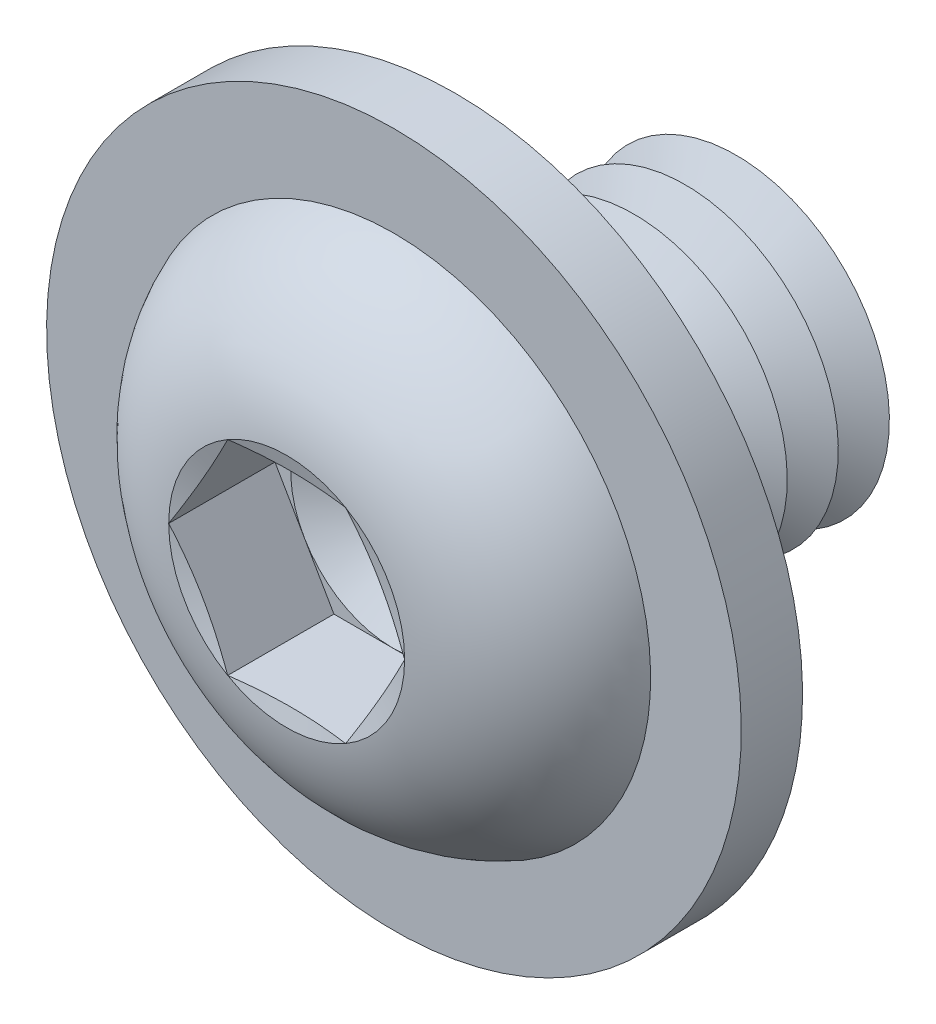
ISO-10303-21;
HEADER;
FILE_DESCRIPTION(('STEP AP214'),'2;1');
FILE_NAME('part.step','',(''),(''),'','','');
FILE_SCHEMA(('AUTOMOTIVE_DESIGN { 1 0 10303 214 1 1 1 1 }'));
ENDSEC;
DATA;
#1=APPLICATION_CONTEXT('core data for automotive mechanical design processes');
#2=APPLICATION_PROTOCOL_DEFINITION('international standard','automotive_design',2000,#1);
#3=PRODUCT_CONTEXT('',#1,'mechanical');
#4=PRODUCT('Part','Part','',(#3));
#5=PRODUCT_RELATED_PRODUCT_CATEGORY('part','',(#4));
#6=PRODUCT_DEFINITION_FORMATION('','',#4);
#7=PRODUCT_DEFINITION_CONTEXT('part definition',#1,'design');
#8=PRODUCT_DEFINITION('design','',#6,#7);
#9=PRODUCT_DEFINITION_SHAPE('','',#8);
#10=(LENGTH_UNIT() NAMED_UNIT(*) SI_UNIT(.MILLI.,.METRE.));
#11=(NAMED_UNIT(*) PLANE_ANGLE_UNIT() SI_UNIT($,.RADIAN.));
#12=(NAMED_UNIT(*) SI_UNIT($,.STERADIAN.) SOLID_ANGLE_UNIT());
#13=UNCERTAINTY_MEASURE_WITH_UNIT(LENGTH_MEASURE(1.E-05),#10,'distance_accuracy_value','');
#14=(GEOMETRIC_REPRESENTATION_CONTEXT(3) GLOBAL_UNCERTAINTY_ASSIGNED_CONTEXT((#13)) GLOBAL_UNIT_ASSIGNED_CONTEXT((#10,
#11,#12)) REPRESENTATION_CONTEXT('',''));
#15=CARTESIAN_POINT('',(0.,0.,0.));
#16=DIRECTION('',(0.,0.,1.));
#17=DIRECTION('',(1.,0.,0.));
#18=AXIS2_PLACEMENT_3D('',#15,#16,#17);
#19=CARTESIAN_POINT('',(0.,0.,-2.50000000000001));
#20=DIRECTION('',(0.,0.,1.));
#21=DIRECTION('',(0.,-1.,0.));
#22=AXIS2_PLACEMENT_3D('',#19,#20,#21);
#23=CONICAL_SURFACE('',#22,2.99999999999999,1.0471975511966);
#24=CARTESIAN_POINT('',(0.,0.,-3.00000000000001));
#25=DIRECTION('',(0.,0.,1.));
#26=DIRECTION('',(0.,-1.,0.));
#27=AXIS2_PLACEMENT_3D('',#24,#25,#26);
#28=CIRCLE('',#27,2.13397459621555);
#29=CARTESIAN_POINT('',(0.,-2.13397459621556,-3.00000000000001));
#30=VERTEX_POINT('',#29);
#31=EDGE_CURVE('E256',#30,#30,#28,.T.);
#32=ORIENTED_EDGE('',*,*,#31,.T.);
#33=EDGE_LOOP('',(#32));
#34=FACE_BOUND('',#33,.T.);
#35=CARTESIAN_POINT('',(0.,0.,-2.50000000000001));
#36=DIRECTION('',(0.,0.,1.));
#37=DIRECTION('',(0.,-1.,0.));
#38=AXIS2_PLACEMENT_3D('',#35,#36,#37);
#39=CIRCLE('',#38,2.99999999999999);
#40=CARTESIAN_POINT('',(0.,-3.,-2.50000000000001));
#41=VERTEX_POINT('',#40);
#42=EDGE_CURVE('E252',#41,#41,#39,.T.);
#43=ORIENTED_EDGE('',*,*,#42,.F.);
#44=EDGE_LOOP('',(#43));
#45=FACE_BOUND('',#44,.T.);
#46=ADVANCED_FACE('F39',(#34,#45),#23,.T.);
#47=CARTESIAN_POINT('',(0.,0.,-3.00000000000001));
#48=DIRECTION('',(0.,0.,-1.));
#49=DIRECTION('',(0.,1.,0.));
#50=AXIS2_PLACEMENT_3D('',#47,#48,#49);
#51=CONICAL_SURFACE('',#50,2.13397459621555,1.0471975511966);
#52=CARTESIAN_POINT('',(0.,0.,-3.50000000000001));
#53=DIRECTION('',(0.,0.,1.));
#54=DIRECTION('',(0.,-1.,0.));
#55=AXIS2_PLACEMENT_3D('',#52,#53,#54);
#56=CIRCLE('',#55,2.99999999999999);
#57=CARTESIAN_POINT('',(0.,-3.,-3.50000000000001));
#58=VERTEX_POINT('',#57);
#59=EDGE_CURVE('E260',#58,#58,#56,.T.);
#60=ORIENTED_EDGE('',*,*,#59,.T.);
#61=EDGE_LOOP('',(#60));
#62=FACE_BOUND('',#61,.T.);
#63=ORIENTED_EDGE('',*,*,#31,.F.);
#64=EDGE_LOOP('',(#63));
#65=FACE_BOUND('',#64,.T.);
#66=ADVANCED_FACE('F377',(#62,#65),#51,.T.);
#67=CARTESIAN_POINT('',(0.,2.99999999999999,-6.));
#68=DIRECTION('',(0.,0.,-1.));
#69=DIRECTION('',(0.,1.,0.));
#70=AXIS2_PLACEMENT_3D('',#67,#68,#69);
#71=PLANE('',#70);
#72=CARTESIAN_POINT('',(0.,0.,-6.00000000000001));
#73=DIRECTION('',(0.,0.,1.));
#74=DIRECTION('',(0.,-1.,0.));
#75=AXIS2_PLACEMENT_3D('',#72,#73,#74);
#76=CIRCLE('',#75,2.13397459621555);
#77=CARTESIAN_POINT('',(0.,-2.13397459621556,-6.00000000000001));
#78=VERTEX_POINT('',#77);
#79=EDGE_CURVE('E280',#78,#78,#76,.T.);
#80=ORIENTED_EDGE('',*,*,#79,.F.);
#81=EDGE_LOOP('',(#80));
#82=FACE_BOUND('',#81,.T.);
#83=ADVANCED_FACE('F383',(#82),#71,.T.);
#84=CARTESIAN_POINT('',(0.,0.,-5.50000000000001));
#85=DIRECTION('',(0.,0.,1.));
#86=DIRECTION('',(0.,-1.,0.));
#87=AXIS2_PLACEMENT_3D('',#84,#85,#86);
#88=CONICAL_SURFACE('',#87,2.99999999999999,1.0471975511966);
#89=ORIENTED_EDGE('',*,*,#79,.T.);
#90=EDGE_LOOP('',(#89));
#91=FACE_BOUND('',#90,.T.);
#92=CARTESIAN_POINT('',(0.,0.,-5.50000000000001));
#93=DIRECTION('',(0.,0.,1.));
#94=DIRECTION('',(0.,-1.,0.));
#95=AXIS2_PLACEMENT_3D('',#92,#93,#94);
#96=CIRCLE('',#95,2.99999999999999);
#97=CARTESIAN_POINT('',(0.,-3.,-5.50000000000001));
#98=VERTEX_POINT('',#97);
#99=EDGE_CURVE('E276',#98,#98,#96,.T.);
#100=ORIENTED_EDGE('',*,*,#99,.F.);
#101=EDGE_LOOP('',(#100));
#102=FACE_BOUND('',#101,.T.);
#103=ADVANCED_FACE('F402',(#91,#102),#88,.T.);
#104=CARTESIAN_POINT('',(0.,0.,-5.00000000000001));
#105=DIRECTION('',(0.,0.,-1.));
#106=DIRECTION('',(0.,1.,0.));
#107=AXIS2_PLACEMENT_3D('',#104,#105,#106);
#108=CONICAL_SURFACE('',#107,2.13397459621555,1.0471975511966);
#109=ORIENTED_EDGE('',*,*,#99,.T.);
#110=EDGE_LOOP('',(#109));
#111=FACE_BOUND('',#110,.T.);
#112=CARTESIAN_POINT('',(0.,0.,-5.00000000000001));
#113=DIRECTION('',(0.,0.,1.));
#114=DIRECTION('',(0.,-1.,0.));
#115=AXIS2_PLACEMENT_3D('',#112,#113,#114);
#116=CIRCLE('',#115,2.13397459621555);
#117=CARTESIAN_POINT('',(0.,-2.13397459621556,-5.00000000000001));
#118=VERTEX_POINT('',#117);
#119=EDGE_CURVE('E272',#118,#118,#116,.T.);
#120=ORIENTED_EDGE('',*,*,#119,.F.);
#121=EDGE_LOOP('',(#120));
#122=FACE_BOUND('',#121,.T.);
#123=ADVANCED_FACE('F399',(#111,#122),#108,.T.);
#124=CARTESIAN_POINT('',(0.,0.,-4.50000000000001));
#125=DIRECTION('',(0.,0.,1.));
#126=DIRECTION('',(0.,-1.,0.));
#127=AXIS2_PLACEMENT_3D('',#124,#125,#126);
#128=CONICAL_SURFACE('',#127,2.99999999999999,1.0471975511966);
#129=ORIENTED_EDGE('',*,*,#119,.T.);
#130=EDGE_LOOP('',(#129));
#131=FACE_BOUND('',#130,.T.);
#132=CARTESIAN_POINT('',(0.,0.,-4.50000000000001));
#133=DIRECTION('',(0.,0.,1.));
#134=DIRECTION('',(0.,-1.,0.));
#135=AXIS2_PLACEMENT_3D('',#132,#133,#134);
#136=CIRCLE('',#135,2.99999999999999);
#137=CARTESIAN_POINT('',(0.,-3.,-4.50000000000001));
#138=VERTEX_POINT('',#137);
#139=EDGE_CURVE('E268',#138,#138,#136,.T.);
#140=ORIENTED_EDGE('',*,*,#139,.F.);
#141=EDGE_LOOP('',(#140));
#142=FACE_BOUND('',#141,.T.);
#143=ADVANCED_FACE('F393',(#131,#142),#128,.T.);
#144=CARTESIAN_POINT('',(0.,0.,-4.00000000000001));
#145=DIRECTION('',(0.,0.,-1.));
#146=DIRECTION('',(0.,1.,0.));
#147=AXIS2_PLACEMENT_3D('',#144,#145,#146);
#148=CONICAL_SURFACE('',#147,2.13397459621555,1.0471975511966);
#149=ORIENTED_EDGE('',*,*,#139,.T.);
#150=EDGE_LOOP('',(#149));
#151=FACE_BOUND('',#150,.T.);
#152=CARTESIAN_POINT('',(0.,0.,-4.00000000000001));
#153=DIRECTION('',(0.,0.,1.));
#154=DIRECTION('',(0.,-1.,0.));
#155=AXIS2_PLACEMENT_3D('',#152,#153,#154);
#156=CIRCLE('',#155,2.13397459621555);
#157=CARTESIAN_POINT('',(0.,-2.13397459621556,-4.00000000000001));
#158=VERTEX_POINT('',#157);
#159=EDGE_CURVE('E264',#158,#158,#156,.T.);
#160=ORIENTED_EDGE('',*,*,#159,.F.);
#161=EDGE_LOOP('',(#160));
#162=FACE_BOUND('',#161,.T.);
#163=ADVANCED_FACE('F389',(#151,#162),#148,.T.);
#164=CARTESIAN_POINT('',(0.,0.,-3.50000000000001));
#165=DIRECTION('',(0.,0.,1.));
#166=DIRECTION('',(0.,-1.,0.));
#167=AXIS2_PLACEMENT_3D('',#164,#165,#166);
#168=CONICAL_SURFACE('',#167,2.99999999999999,1.0471975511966);
#169=ORIENTED_EDGE('',*,*,#159,.T.);
#170=EDGE_LOOP('',(#169));
#171=FACE_BOUND('',#170,.T.);
#172=ORIENTED_EDGE('',*,*,#59,.F.);
#173=EDGE_LOOP('',(#172));
#174=FACE_BOUND('',#173,.T.);
#175=ADVANCED_FACE('F392',(#171,#174),#168,.T.);
#176=CARTESIAN_POINT('',(0.,0.,-1.50000000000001));
#177=DIRECTION('',(0.,0.,1.));
#178=DIRECTION('',(0.,-1.,0.));
#179=AXIS2_PLACEMENT_3D('',#176,#177,#178);
#180=CONICAL_SURFACE('',#179,2.99999999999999,1.0471975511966);
#181=CARTESIAN_POINT('',(0.,0.,-2.00000000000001));
#182=DIRECTION('',(0.,0.,1.));
#183=DIRECTION('',(0.,-1.,0.));
#184=AXIS2_PLACEMENT_3D('',#181,#182,#183);
#185=CIRCLE('',#184,2.13397459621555);
#186=CARTESIAN_POINT('',(0.,-2.13397459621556,-2.00000000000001));
#187=VERTEX_POINT('',#186);
#188=EDGE_CURVE('E249',#187,#187,#185,.T.);
#189=ORIENTED_EDGE('',*,*,#188,.T.);
#190=EDGE_LOOP('',(#189));
#191=FACE_BOUND('',#190,.T.);
#192=CARTESIAN_POINT('',(0.,0.,-1.50000000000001));
#193=DIRECTION('',(0.,0.,1.));
#194=DIRECTION('',(0.,-1.,0.));
#195=AXIS2_PLACEMENT_3D('',#192,#193,#194);
#196=CIRCLE('',#195,2.99999999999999);
#197=CARTESIAN_POINT('',(0.,-3.,-1.50000000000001));
#198=VERTEX_POINT('',#197);
#199=EDGE_CURVE('E241',#198,#198,#196,.T.);
#200=ORIENTED_EDGE('',*,*,#199,.F.);
#201=EDGE_LOOP('',(#200));
#202=FACE_BOUND('',#201,.T.);
#203=ADVANCED_FACE('F397',(#191,#202),#180,.T.);
#204=CARTESIAN_POINT('',(0.,0.,-2.00000000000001));
#205=DIRECTION('',(0.,0.,-1.));
#206=DIRECTION('',(0.,1.,0.));
#207=AXIS2_PLACEMENT_3D('',#204,#205,#206);
#208=CONICAL_SURFACE('',#207,2.13397459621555,1.0471975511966);
#209=ORIENTED_EDGE('',*,*,#42,.T.);
#210=EDGE_LOOP('',(#209));
#211=FACE_BOUND('',#210,.T.);
#212=ORIENTED_EDGE('',*,*,#188,.F.);
#213=EDGE_LOOP('',(#212));
#214=FACE_BOUND('',#213,.T.);
#215=ADVANCED_FACE('F448',(#211,#214),#208,.T.);
#216=CARTESIAN_POINT('',(0.,0.,-0.500000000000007));
#217=DIRECTION('',(0.,0.,1.));
#218=DIRECTION('',(0.,-1.,0.));
#219=AXIS2_PLACEMENT_3D('',#216,#217,#218);
#220=CONICAL_SURFACE('',#219,2.99999999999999,1.0471975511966);
#221=CARTESIAN_POINT('',(0.,0.,-1.00000000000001));
#222=DIRECTION('',(0.,0.,1.));
#223=DIRECTION('',(0.,-1.,0.));
#224=AXIS2_PLACEMENT_3D('',#221,#222,#223);
#225=CIRCLE('',#224,2.13397459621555);
#226=CARTESIAN_POINT('',(0.,-2.13397459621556,-1.00000000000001));
#227=VERTEX_POINT('',#226);
#228=EDGE_CURVE('E231',#227,#227,#225,.T.);
#229=ORIENTED_EDGE('',*,*,#228,.T.);
#230=EDGE_LOOP('',(#229));
#231=FACE_BOUND('',#230,.T.);
#232=CARTESIAN_POINT('',(0.,0.,-0.500000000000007));
#233=DIRECTION('',(0.,0.,1.));
#234=DIRECTION('',(0.,-1.,0.));
#235=AXIS2_PLACEMENT_3D('',#232,#233,#234);
#236=CIRCLE('',#235,2.99999999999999);
#237=CARTESIAN_POINT('',(0.,-3.,-0.500000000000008));
#238=VERTEX_POINT('',#237);
#239=EDGE_CURVE('E245',#238,#238,#236,.T.);
#240=ORIENTED_EDGE('',*,*,#239,.F.);
#241=EDGE_LOOP('',(#240));
#242=FACE_BOUND('',#241,.T.);
#243=ADVANCED_FACE('F454',(#231,#242),#220,.T.);
#244=CARTESIAN_POINT('',(0.,0.,-1.00000000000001));
#245=DIRECTION('',(0.,0.,-1.));
#246=DIRECTION('',(0.,1.,0.));
#247=AXIS2_PLACEMENT_3D('',#244,#245,#246);
#248=CONICAL_SURFACE('',#247,2.13397459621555,1.0471975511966);
#249=ORIENTED_EDGE('',*,*,#199,.T.);
#250=EDGE_LOOP('',(#249));
#251=FACE_BOUND('',#250,.T.);
#252=ORIENTED_EDGE('',*,*,#228,.F.);
#253=EDGE_LOOP('',(#252));
#254=FACE_BOUND('',#253,.T.);
#255=ADVANCED_FACE('F220',(#251,#254),#248,.T.);
#256=CARTESIAN_POINT('',(0.,2.99999999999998,0.));
#257=DIRECTION('',(0.,0.,-1.));
#258=DIRECTION('',(0.,1.,0.));
#259=AXIS2_PLACEMENT_3D('',#256,#257,#258);
#260=PLANE('',#259);
#261=CARTESIAN_POINT('',(0.,0.,0.));
#262=DIRECTION('',(0.,0.,-1.));
#263=DIRECTION('',(0.,1.,0.));
#264=AXIS2_PLACEMENT_3D('',#261,#262,#263);
#265=CIRCLE('',#264,3.49999999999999);
#266=CARTESIAN_POINT('',(0.,3.49999999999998,0.));
#267=VERTEX_POINT('',#266);
#268=EDGE_CURVE('E289',#267,#267,#265,.F.);
#269=ORIENTED_EDGE('',*,*,#268,.T.);
#270=EDGE_LOOP('',(#269));
#271=FACE_BOUND('',#270,.T.);
#272=CARTESIAN_POINT('',(0.,0.,0.));
#273=DIRECTION('',(0.,0.,-1.));
#274=DIRECTION('',(0.,1.,0.));
#275=AXIS2_PLACEMENT_3D('',#272,#273,#274);
#276=CIRCLE('',#275,6.8);
#277=CARTESIAN_POINT('',(0.,6.8,0.));
#278=VERTEX_POINT('',#277);
#279=EDGE_CURVE('E735',#278,#278,#276,.T.);
#280=ORIENTED_EDGE('',*,*,#279,.T.);
#281=EDGE_LOOP('',(#280));
#282=FACE_BOUND('',#281,.T.);
#283=ADVANCED_FACE('F466',(#271,#282),#260,.T.);
#284=CARTESIAN_POINT('',(0.,0.,-0.500000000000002));
#285=DIRECTION('',(0.,0.,-1.));
#286=DIRECTION('',(0.,1.,0.));
#287=AXIS2_PLACEMENT_3D('',#284,#285,#286);
#288=TOROIDAL_SURFACE('',#287,3.49999999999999,0.5);
#289=ORIENTED_EDGE('',*,*,#268,.F.);
#290=EDGE_LOOP('',(#289));
#291=FACE_BOUND('',#290,.T.);
#292=ORIENTED_EDGE('',*,*,#239,.T.);
#293=EDGE_LOOP('',(#292));
#294=FACE_BOUND('',#293,.T.);
#295=ADVANCED_FACE('F41',(#291,#294),#288,.F.);
#296=CARTESIAN_POINT('',(0.,0.,1.2));
#297=DIRECTION('',(0.,0.,-1.));
#298=DIRECTION('',(0.,1.,0.));
#299=AXIS2_PLACEMENT_3D('',#296,#297,#298);
#300=CYLINDRICAL_SURFACE('',#299,6.8);
#301=CARTESIAN_POINT('',(0.,0.,1.2));
#302=DIRECTION('',(0.,0.,-1.));
#303=DIRECTION('',(0.,1.,0.));
#304=AXIS2_PLACEMENT_3D('',#301,#302,#303);
#305=CIRCLE('',#304,6.8);
#306=CARTESIAN_POINT('',(0.,6.8,1.2));
#307=VERTEX_POINT('',#306);
#308=EDGE_CURVE('E731',#307,#307,#305,.T.);
#309=ORIENTED_EDGE('',*,*,#308,.T.);
#310=EDGE_LOOP('',(#309));
#311=FACE_BOUND('',#310,.T.);
#312=ORIENTED_EDGE('',*,*,#279,.F.);
#313=EDGE_LOOP('',(#312));
#314=FACE_BOUND('',#313,.T.);
#315=ADVANCED_FACE('F477',(#311,#314),#300,.T.);
#316=CARTESIAN_POINT('',(0.,0.,1.2));
#317=DIRECTION('',(0.,0.,-1.));
#318=DIRECTION('',(0.,1.,0.));
#319=AXIS2_PLACEMENT_3D('',#316,#317,#318);
#320=PLANE('',#319);
#321=CARTESIAN_POINT('',(0.,0.,1.2));
#322=DIRECTION('',(0.,0.,-1.));
#323=DIRECTION('',(0.,1.,0.));
#324=AXIS2_PLACEMENT_3D('',#321,#322,#323);
#325=CIRCLE('',#324,5.02568742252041);
#326=CARTESIAN_POINT('',(0.,5.0256874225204,1.2));
#327=VERTEX_POINT('',#326);
#328=EDGE_CURVE('E43',#327,#327,#325,.F.);
#329=ORIENTED_EDGE('',*,*,#328,.F.);
#330=EDGE_LOOP('',(#329));
#331=FACE_BOUND('',#330,.T.);
#332=ORIENTED_EDGE('',*,*,#308,.F.);
#333=EDGE_LOOP('',(#332));
#334=FACE_BOUND('',#333,.T.);
#335=ADVANCED_FACE('F117',(#331,#334),#320,.F.);
#336=CARTESIAN_POINT('',(0.,0.,1.22));
#337=DIRECTION('',(0.,0.,1.));
#338=DIRECTION('',(1.,0.,0.));
#339=AXIS2_PLACEMENT_3D('',#336,#337,#338);
#340=CONICAL_SURFACE('',#339,1.99999906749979,1.0471975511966);
#341=CARTESIAN_POINT('',(0.,0.,0.0653000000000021));
#342=VERTEX_POINT('',#341);
#343=VERTEX_LOOP('',#342);
#344=FACE_BOUND('',#343,.T.);
#345=CARTESIAN_POINT('',(0.,0.,1.22));
#346=DIRECTION('',(0.,0.,1.));
#347=DIRECTION('',(1.,0.,0.));
#348=AXIS2_PLACEMENT_3D('',#345,#346,#347);
#349=CIRCLE('',#348,1.99999906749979);
#350=CARTESIAN_POINT('',(1.73205,0.999999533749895,1.22));
#351=VERTEX_POINT('',#350);
#352=CARTESIAN_POINT('',(0.,1.99999906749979,1.22));
#353=VERTEX_POINT('',#352);
#354=EDGE_CURVE('E120',#351,#353,#349,.T.);
#355=ORIENTED_EDGE('',*,*,#354,.T.);
#356=CARTESIAN_POINT('',(0.,0.,1.22));
#357=DIRECTION('',(0.,0.,1.));
#358=DIRECTION('',(1.,0.,0.));
#359=AXIS2_PLACEMENT_3D('',#356,#357,#358);
#360=CIRCLE('',#359,1.99999906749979);
#361=CARTESIAN_POINT('',(-1.73205000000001,0.999999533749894,1.22));
#362=VERTEX_POINT('',#361);
#363=EDGE_CURVE('E11',#353,#362,#360,.T.);
#364=ORIENTED_EDGE('',*,*,#363,.T.);
#365=CARTESIAN_POINT('',(-1.73205000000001,-0.999999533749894,1.22));
#366=VERTEX_POINT('',#365);
#367=EDGE_CURVE('E49',#362,#366,#360,.T.);
#368=ORIENTED_EDGE('',*,*,#367,.T.);
#369=CARTESIAN_POINT('',(0.,-1.99999906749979,1.22));
#370=VERTEX_POINT('',#369);
#371=EDGE_CURVE('E296',#366,#370,#360,.T.);
#372=ORIENTED_EDGE('',*,*,#371,.T.);
#373=CARTESIAN_POINT('',(1.73205000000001,-0.999999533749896,1.22));
#374=VERTEX_POINT('',#373);
#375=EDGE_CURVE('E57',#370,#374,#360,.T.);
#376=ORIENTED_EDGE('',*,*,#375,.T.);
#377=EDGE_CURVE('E50',#374,#351,#360,.T.);
#378=ORIENTED_EDGE('',*,*,#377,.T.);
#379=EDGE_LOOP('',(#355,#364,#368,#372,#376,#378));
#380=FACE_BOUND('',#379,.T.);
#381=ADVANCED_FACE('F114',(#344,#380),#340,.F.);
#382=CARTESIAN_POINT('',(0.,0.,1.22));
#383=DIRECTION('',(0.,0.,1.));
#384=DIRECTION('',(1.,0.,0.));
#385=AXIS2_PLACEMENT_3D('',#382,#383,#384);
#386=PLANE('',#385);
#387=ORIENTED_EDGE('',*,*,#363,.F.);
#388=DIRECTION('',(-1.,0.,0.));
#389=VECTOR('',#388,1.);
#390=CARTESIAN_POINT('',(1.1547,1.99999906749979,1.22));
#391=LINE('',#390,#389);
#392=CARTESIAN_POINT('',(-1.1547,1.99999906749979,1.22));
#393=VERTEX_POINT('',#392);
#394=EDGE_CURVE('E132',#353,#393,#391,.T.);
#395=ORIENTED_EDGE('',*,*,#394,.T.);
#396=DIRECTION('',(-0.5,-0.866025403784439,0.));
#397=VECTOR('',#396,1.);
#398=CARTESIAN_POINT('',(-1.1547,1.99999906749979,1.22));
#399=LINE('',#398,#397);
#400=EDGE_CURVE('E135',#393,#362,#399,.T.);
#401=ORIENTED_EDGE('',*,*,#400,.T.);
#402=EDGE_LOOP('',(#387,#395,#401));
#403=FACE_BOUND('',#402,.T.);
#404=ADVANCED_FACE('F116',(#403),#386,.T.);
#405=ORIENTED_EDGE('',*,*,#367,.F.);
#406=CARTESIAN_POINT('',(-2.30940000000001,0.,1.22));
#407=VERTEX_POINT('',#406);
#408=EDGE_CURVE('E145',#362,#407,#399,.T.);
#409=ORIENTED_EDGE('',*,*,#408,.T.);
#410=DIRECTION('',(0.5,-0.866025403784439,0.));
#411=VECTOR('',#410,1.);
#412=CARTESIAN_POINT('',(-2.30940000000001,0.,1.22));
#413=LINE('',#412,#411);
#414=EDGE_CURVE('E154',#407,#366,#413,.T.);
#415=ORIENTED_EDGE('',*,*,#414,.T.);
#416=EDGE_LOOP('',(#405,#409,#415));
#417=FACE_BOUND('',#416,.T.);
#418=ADVANCED_FACE('F313',(#417),#386,.T.);
#419=ORIENTED_EDGE('',*,*,#371,.F.);
#420=CARTESIAN_POINT('',(-1.1547,-1.99999906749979,1.22));
#421=VERTEX_POINT('',#420);
#422=EDGE_CURVE('E153',#366,#421,#413,.T.);
#423=ORIENTED_EDGE('',*,*,#422,.T.);
#424=DIRECTION('',(1.,0.,0.));
#425=VECTOR('',#424,1.);
#426=CARTESIAN_POINT('',(-1.1547,-1.99999906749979,1.22));
#427=LINE('',#426,#425);
#428=EDGE_CURVE('E159',#421,#370,#427,.T.);
#429=ORIENTED_EDGE('',*,*,#428,.T.);
#430=EDGE_LOOP('',(#419,#423,#429));
#431=FACE_BOUND('',#430,.T.);
#432=ADVANCED_FACE('F307',(#431),#386,.T.);
#433=ORIENTED_EDGE('',*,*,#375,.F.);
#434=CARTESIAN_POINT('',(1.1547,-1.99999906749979,1.22));
#435=VERTEX_POINT('',#434);
#436=EDGE_CURVE('E158',#370,#435,#427,.T.);
#437=ORIENTED_EDGE('',*,*,#436,.T.);
#438=DIRECTION('',(0.5,0.866025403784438,0.));
#439=VECTOR('',#438,1.);
#440=CARTESIAN_POINT('',(1.1547,-1.99999906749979,1.22));
#441=LINE('',#440,#439);
#442=EDGE_CURVE('E164',#435,#374,#441,.T.);
#443=ORIENTED_EDGE('',*,*,#442,.T.);
#444=EDGE_LOOP('',(#433,#437,#443));
#445=FACE_BOUND('',#444,.T.);
#446=ADVANCED_FACE('F506',(#445),#386,.T.);
#447=ORIENTED_EDGE('',*,*,#377,.F.);
#448=CARTESIAN_POINT('',(2.30940000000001,0.,1.22));
#449=VERTEX_POINT('',#448);
#450=EDGE_CURVE('E163',#374,#449,#441,.T.);
#451=ORIENTED_EDGE('',*,*,#450,.T.);
#452=DIRECTION('',(-0.5,0.866025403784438,0.));
#453=VECTOR('',#452,1.);
#454=CARTESIAN_POINT('',(2.30940000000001,0.,1.22));
#455=LINE('',#454,#453);
#456=EDGE_CURVE('E141',#449,#351,#455,.T.);
#457=ORIENTED_EDGE('',*,*,#456,.T.);
#458=EDGE_LOOP('',(#447,#451,#457));
#459=FACE_BOUND('',#458,.T.);
#460=ADVANCED_FACE('F511',(#459),#386,.T.);
#461=ORIENTED_EDGE('',*,*,#354,.F.);
#462=CARTESIAN_POINT('',(1.1547,1.99999906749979,1.22));
#463=VERTEX_POINT('',#462);
#464=EDGE_CURVE('E127',#351,#463,#455,.T.);
#465=ORIENTED_EDGE('',*,*,#464,.T.);
#466=EDGE_CURVE('E137',#463,#353,#391,.T.);
#467=ORIENTED_EDGE('',*,*,#466,.T.);
#468=EDGE_LOOP('',(#461,#465,#467));
#469=FACE_BOUND('',#468,.T.);
#470=ADVANCED_FACE('F143',(#469),#386,.T.);
#471=CARTESIAN_POINT('',(1.1547,1.99999906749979,1.22));
#472=DIRECTION('',(0.,1.,0.));
#473=DIRECTION('',(-1.,0.,0.));
#474=AXIS2_PLACEMENT_3D('',#471,#472,#473);
#475=PLANE('',#474);
#476=CARTESIAN_POINT('',(3.48493375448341,1.99999906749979,3.75783251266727));
#477=CARTESIAN_POINT('',(3.40057136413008,1.99999906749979,3.7382285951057));
#478=CARTESIAN_POINT('',(3.31617090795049,1.99999906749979,3.71878852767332));
#479=CARTESIAN_POINT('',(3.14727791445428,1.99999906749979,3.68030638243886));
#480=CARTESIAN_POINT('',(3.06278537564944,1.99999906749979,3.66126431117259));
#481=CARTESIAN_POINT('',(2.80911712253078,1.99999906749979,3.60483420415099));
#482=CARTESIAN_POINT('',(2.63978343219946,1.99999906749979,3.5681499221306));
#483=CARTESIAN_POINT('',(2.2989542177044,1.99999906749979,3.49717072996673));
#484=CARTESIAN_POINT('',(2.12745330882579,1.99999906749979,3.4629014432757));
#485=CARTESIAN_POINT('',(1.78364663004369,1.99999906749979,3.39849485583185));
#486=CARTESIAN_POINT('',(1.61134079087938,1.99999906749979,3.36835791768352));
#487=CARTESIAN_POINT('',(1.27040784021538,1.99999906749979,3.31501553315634));
#488=CARTESIAN_POINT('',(1.10180724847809,1.99999906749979,3.29164468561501));
#489=CARTESIAN_POINT('',(0.763641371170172,1.99999906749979,3.2533727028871));
#490=CARTESIAN_POINT('',(0.594076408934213,1.99999906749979,3.23846888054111));
#491=CARTESIAN_POINT('',(0.339649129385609,1.99999906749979,3.22431372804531));
#492=CARTESIAN_POINT('',(0.255009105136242,1.99999906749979,3.22096057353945));
#493=CARTESIAN_POINT('',(0.0856618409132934,1.99999906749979,3.21711210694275));
#494=CARTESIAN_POINT('',(0.000954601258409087,1.99999906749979,3.21661678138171));
#495=CARTESIAN_POINT('',(-0.168430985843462,1.99999906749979,3.21851478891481));
#496=CARTESIAN_POINT('',(-0.253109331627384,1.99999906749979,3.22090826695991));
#497=CARTESIAN_POINT('',(-0.422344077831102,1.99999906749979,3.22845792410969));
#498=CARTESIAN_POINT('',(-0.506900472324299,1.99999906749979,3.23361423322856));
#499=CARTESIAN_POINT('',(-0.712240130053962,1.99999906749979,3.24921577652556));
#500=CARTESIAN_POINT('',(-0.8329229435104,1.99999906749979,3.26098285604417));
#501=CARTESIAN_POINT('',(-1.07378161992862,1.99999906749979,3.28874908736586));
#502=CARTESIAN_POINT('',(-1.19395750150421,1.99999906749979,3.30474808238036));
#503=CARTESIAN_POINT('',(-1.43419655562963,1.99999906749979,3.34009172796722));
#504=CARTESIAN_POINT('',(-1.55425817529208,1.99999906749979,3.35944677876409));
#505=CARTESIAN_POINT('',(-1.79394991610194,1.99999906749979,3.40067076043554));
#506=CARTESIAN_POINT('',(-1.91358001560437,1.99999906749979,3.42253981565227));
#507=CARTESIAN_POINT('',(-2.15493405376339,1.99999906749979,3.46864194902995));
#508=CARTESIAN_POINT('',(-2.27665041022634,1.99999906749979,3.49291441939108));
#509=CARTESIAN_POINT('',(-2.51977680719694,1.99999906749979,3.54294628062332));
#510=CARTESIAN_POINT('',(-2.64118684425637,1.99999906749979,3.56870568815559));
#511=CARTESIAN_POINT('',(-2.88310060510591,1.99999906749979,3.6212089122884));
#512=CARTESIAN_POINT('',(-3.00360566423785,1.99999906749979,3.6479466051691));
#513=CARTESIAN_POINT('',(-3.24441021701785,1.99999906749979,3.7022947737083));
#514=CARTESIAN_POINT('',(-3.36470972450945,1.99999906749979,3.72990518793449));
#515=CARTESIAN_POINT('',(-3.48493375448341,1.99999906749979,3.75783251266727));
#516=B_SPLINE_CURVE_WITH_KNOTS('',3,(#476,#477,#478,#479,#480,#481,#482,#483,#484,#485,#486,
#487,#488,#489,#490,#491,#492,#493,#494,#495,#496,#497,#498,#499,#500,#501,#502,#503,#504,#505,
#506,#507,#508,#509,#510,#511,#512,#513,#514,#515),.UNSPECIFIED.,.F.,.F.,(4,2,2,2,2,2,2,2,2,2,2,
2,2,2,2,2,2,2,2,4),(0.,0.259830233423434,0.519664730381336,1.03943435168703,1.56407662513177,
2.08876490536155,2.59926476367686,3.10960251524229,3.36367930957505,3.61775490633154,
3.87184325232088,4.12594355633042,4.48960924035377,4.85326145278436,5.21806142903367,
5.58287945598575,5.95520617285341,6.32753706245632,6.69784064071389,7.06811821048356),.UNSPECIFIED.);
#517=CARTESIAN_POINT('',(1.15469999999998,1.9999990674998,3.3));
#518=VERTEX_POINT('',#517);
#519=CARTESIAN_POINT('',(-1.1547,1.99999906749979,3.3));
#520=VERTEX_POINT('',#519);
#521=EDGE_CURVE('E172',#518,#520,#516,.T.);
#522=ORIENTED_EDGE('',*,*,#521,.T.);
#523=DIRECTION('',(0.,0.,1.));
#524=VECTOR('',#523,1.);
#525=CARTESIAN_POINT('',(-1.1547,1.99999906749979,1.22));
#526=LINE('',#525,#524);
#527=EDGE_CURVE('E139',#393,#520,#526,.T.);
#528=ORIENTED_EDGE('',*,*,#527,.F.);
#529=ORIENTED_EDGE('',*,*,#394,.F.);
#530=ORIENTED_EDGE('',*,*,#466,.F.);
#531=DIRECTION('',(0.,0.,1.));
#532=VECTOR('',#531,1.);
#533=CARTESIAN_POINT('',(1.1547,1.99999906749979,1.22));
#534=LINE('',#533,#532);
#535=EDGE_CURVE('E65',#463,#518,#534,.T.);
#536=ORIENTED_EDGE('',*,*,#535,.T.);
#537=EDGE_LOOP('',(#522,#528,#529,#530,#536));
#538=FACE_BOUND('',#537,.T.);
#539=ADVANCED_FACE('F136',(#538),#475,.F.);
#540=CARTESIAN_POINT('',(-1.1547,1.99999906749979,1.22));
#541=DIRECTION('',(-0.866025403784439,0.5,0.));
#542=DIRECTION('',(-0.5,-0.866025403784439,0.));
#543=AXIS2_PLACEMENT_3D('',#540,#541,#542);
#544=PLANE('',#543);
#545=CARTESIAN_POINT('',(-1.15458452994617,2.00019906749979,3.30003094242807));
#546=CARTESIAN_POINT('',(-1.20254587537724,1.91712758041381,3.2871729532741));
#547=CARTESIAN_POINT('',(-1.25059419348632,1.83390545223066,3.27549992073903));
#548=CARTESIAN_POINT('',(-1.34686055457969,1.66716722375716,3.2549913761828));
#549=CARTESIAN_POINT('',(-1.39507865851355,1.58365101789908,3.24615701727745));
#550=CARTESIAN_POINT('',(-1.49139217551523,1.41683111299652,3.23184167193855));
#551=CARTESIAN_POINT('',(-1.53948693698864,1.33352854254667,3.22634360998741));
#552=CARTESIAN_POINT('',(-1.63573780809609,1.1668171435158,3.21897125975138));
#553=CARTESIAN_POINT('',(-1.68389390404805,1.08340833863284,3.21709626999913));
#554=CARTESIAN_POINT('',(-1.78020609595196,0.916590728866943,3.21709626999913));
#555=CARTESIAN_POINT('',(-1.82836219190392,0.833181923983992,3.21897125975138));
#556=CARTESIAN_POINT('',(-1.92461306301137,0.666470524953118,3.22634360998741));
#557=CARTESIAN_POINT('',(-1.97270782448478,0.583167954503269,3.23184167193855));
#558=CARTESIAN_POINT('',(-2.06902134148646,0.416348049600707,3.24615701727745));
#559=CARTESIAN_POINT('',(-2.11723944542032,0.332831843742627,3.2549913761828));
#560=CARTESIAN_POINT('',(-2.2135058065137,0.166093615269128,3.27549992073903));
#561=CARTESIAN_POINT('',(-2.26155412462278,0.0828714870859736,3.2871729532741));
#562=CARTESIAN_POINT('',(-2.30951547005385,-0.00020000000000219,3.30003094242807));
#563=B_SPLINE_CURVE_WITH_KNOTS('',3,(#545,#546,#547,#548,#549,#550,#551,#552,#553,#554,#555,
#556,#557,#558,#559,#560,#561,#562),.UNSPECIFIED.,.F.,.F.,(4,2,2,2,2,2,2,2,4),(0.,
0.29035711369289,0.580832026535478,0.869807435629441,1.15872689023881,1.44764634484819,
1.73662175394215,2.02709666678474,2.31745378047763),.UNSPECIFIED.);
#564=CARTESIAN_POINT('',(-2.30940000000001,0.,3.3));
#565=VERTEX_POINT('',#564);
#566=EDGE_CURVE('E197',#520,#565,#563,.T.);
#567=ORIENTED_EDGE('',*,*,#566,.T.);
#568=DIRECTION('',(0.,0.,1.));
#569=VECTOR('',#568,1.);
#570=CARTESIAN_POINT('',(-2.30940000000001,0.,1.22));
#571=LINE('',#570,#569);
#572=EDGE_CURVE('E181',#407,#565,#571,.T.);
#573=ORIENTED_EDGE('',*,*,#572,.F.);
#574=ORIENTED_EDGE('',*,*,#408,.F.);
#575=ORIENTED_EDGE('',*,*,#400,.F.);
#576=ORIENTED_EDGE('',*,*,#527,.T.);
#577=EDGE_LOOP('',(#567,#573,#574,#575,#576));
#578=FACE_BOUND('',#577,.T.);
#579=ADVANCED_FACE('F211',(#578),#544,.F.);
#580=CARTESIAN_POINT('',(-2.30940000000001,0.,1.22));
#581=DIRECTION('',(-0.866025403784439,-0.5,0.));
#582=DIRECTION('',(0.5,-0.866025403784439,0.));
#583=AXIS2_PLACEMENT_3D('',#580,#581,#582);
#584=PLANE('',#583);
#585=CARTESIAN_POINT('',(-2.30951547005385,0.000199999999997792,3.30003094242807));
#586=CARTESIAN_POINT('',(-2.26155412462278,-0.0828714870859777,3.2871729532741));
#587=CARTESIAN_POINT('',(-2.2135058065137,-0.166093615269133,3.27549992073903));
#588=CARTESIAN_POINT('',(-2.11723944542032,-0.332831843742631,3.2549913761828));
#589=CARTESIAN_POINT('',(-2.06902134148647,-0.416348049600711,3.24615701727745));
#590=CARTESIAN_POINT('',(-1.97270782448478,-0.583167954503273,3.23184167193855));
#591=CARTESIAN_POINT('',(-1.92461306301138,-0.666470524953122,3.22634360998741));
#592=CARTESIAN_POINT('',(-1.82836219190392,-0.833181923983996,3.21897125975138));
#593=CARTESIAN_POINT('',(-1.78020609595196,-0.916590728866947,3.21709626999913));
#594=CARTESIAN_POINT('',(-1.68389390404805,-1.08340833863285,3.21709626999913));
#595=CARTESIAN_POINT('',(-1.63573780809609,-1.1668171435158,3.21897125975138));
#596=CARTESIAN_POINT('',(-1.53948693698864,-1.33352854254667,3.22634360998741));
#597=CARTESIAN_POINT('',(-1.49139217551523,-1.41683111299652,3.23184167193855));
#598=CARTESIAN_POINT('',(-1.39507865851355,-1.58365101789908,3.24615701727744));
#599=CARTESIAN_POINT('',(-1.34686055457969,-1.66716722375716,3.2549913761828));
#600=CARTESIAN_POINT('',(-1.25059419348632,-1.83390545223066,3.27549992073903));
#601=CARTESIAN_POINT('',(-1.20254587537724,-1.91712758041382,3.2871729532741));
#602=CARTESIAN_POINT('',(-1.15458452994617,-2.00019906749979,3.30003094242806));
#603=B_SPLINE_CURVE_WITH_KNOTS('',3,(#585,#586,#587,#588,#589,#590,#591,#592,#593,#594,#595,
#596,#597,#598,#599,#600,#601,#602),.UNSPECIFIED.,.F.,.F.,(4,2,2,2,2,2,2,2,4),(0.,
0.29035711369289,0.580832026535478,0.869807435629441,1.15872689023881,1.44764634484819,
1.73662175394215,2.02709666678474,2.31745378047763),.UNSPECIFIED.);
#604=CARTESIAN_POINT('',(-1.1547,-1.99999906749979,3.3));
#605=VERTEX_POINT('',#604);
#606=EDGE_CURVE('E318',#565,#605,#603,.T.);
#607=ORIENTED_EDGE('',*,*,#606,.T.);
#608=DIRECTION('',(0.,0.,1.));
#609=VECTOR('',#608,1.);
#610=CARTESIAN_POINT('',(-1.1547,-1.99999906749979,1.22));
#611=LINE('',#610,#609);
#612=EDGE_CURVE('E177',#421,#605,#611,.T.);
#613=ORIENTED_EDGE('',*,*,#612,.F.);
#614=ORIENTED_EDGE('',*,*,#422,.F.);
#615=ORIENTED_EDGE('',*,*,#414,.F.);
#616=ORIENTED_EDGE('',*,*,#572,.T.);
#617=EDGE_LOOP('',(#607,#613,#614,#615,#616));
#618=FACE_BOUND('',#617,.T.);
#619=ADVANCED_FACE('F312',(#618),#584,.F.);
#620=CARTESIAN_POINT('',(-1.1547,-1.99999906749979,1.22));
#621=DIRECTION('',(0.,-1.,0.));
#622=DIRECTION('',(0.,0.,-1.));
#623=AXIS2_PLACEMENT_3D('',#620,#621,#622);
#624=PLANE('',#623);
#625=CARTESIAN_POINT('',(-3.48493375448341,-1.99999906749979,3.75783251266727));
#626=CARTESIAN_POINT('',(-3.40057136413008,-1.99999906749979,3.73822859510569));
#627=CARTESIAN_POINT('',(-3.31617090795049,-1.99999906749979,3.71878852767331));
#628=CARTESIAN_POINT('',(-3.14727791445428,-1.99999906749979,3.68030638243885));
#629=CARTESIAN_POINT('',(-3.06278537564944,-1.99999906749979,3.66126431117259));
#630=CARTESIAN_POINT('',(-2.80911712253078,-1.99999906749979,3.60483420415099));
#631=CARTESIAN_POINT('',(-2.63978343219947,-1.99999906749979,3.56814992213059));
#632=CARTESIAN_POINT('',(-2.2989542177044,-1.99999906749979,3.49717072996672));
#633=CARTESIAN_POINT('',(-2.12745330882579,-1.99999906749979,3.4629014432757));
#634=CARTESIAN_POINT('',(-1.7836466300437,-1.99999906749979,3.39849485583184));
#635=CARTESIAN_POINT('',(-1.61134079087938,-1.99999906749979,3.36835791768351));
#636=CARTESIAN_POINT('',(-1.27040784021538,-1.99999906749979,3.31501553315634));
#637=CARTESIAN_POINT('',(-1.10180724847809,-1.99999906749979,3.291644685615));
#638=CARTESIAN_POINT('',(-0.763641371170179,-1.99999906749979,3.25337270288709));
#639=CARTESIAN_POINT('',(-0.59407640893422,-1.99999906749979,3.23846888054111));
#640=CARTESIAN_POINT('',(-0.339649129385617,-1.99999906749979,3.22431372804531));
#641=CARTESIAN_POINT('',(-0.255009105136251,-1.99999906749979,3.22096057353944));
#642=CARTESIAN_POINT('',(-0.0856618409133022,-1.99999906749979,3.21711210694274));
#643=CARTESIAN_POINT('',(-0.000954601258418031,-1.99999906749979,3.2166167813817));
#644=CARTESIAN_POINT('',(0.168430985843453,-1.99999906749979,3.21851478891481));
#645=CARTESIAN_POINT('',(0.253109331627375,-1.99999906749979,3.2209082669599));
#646=CARTESIAN_POINT('',(0.422344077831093,-1.99999906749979,3.22845792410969));
#647=CARTESIAN_POINT('',(0.506900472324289,-1.99999906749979,3.23361423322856));
#648=CARTESIAN_POINT('',(0.712240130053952,-1.99999906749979,3.24921577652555));
#649=CARTESIAN_POINT('',(0.83292294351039,-1.99999906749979,3.26098285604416));
#650=CARTESIAN_POINT('',(1.07378161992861,-1.99999906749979,3.28874908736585));
#651=CARTESIAN_POINT('',(1.1939575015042,-1.99999906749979,3.30474808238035));
#652=CARTESIAN_POINT('',(1.43419655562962,-1.99999906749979,3.34009172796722));
#653=CARTESIAN_POINT('',(1.55425817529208,-1.99999906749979,3.35944677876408));
#654=CARTESIAN_POINT('',(1.79394991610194,-1.99999906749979,3.40067076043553));
#655=CARTESIAN_POINT('',(1.91358001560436,-1.99999906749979,3.42253981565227));
#656=CARTESIAN_POINT('',(2.15493405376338,-1.99999906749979,3.46864194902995));
#657=CARTESIAN_POINT('',(2.27665041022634,-1.99999906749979,3.49291441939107));
#658=CARTESIAN_POINT('',(2.51977680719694,-1.99999906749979,3.54294628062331));
#659=CARTESIAN_POINT('',(2.64118684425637,-1.99999906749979,3.56870568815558));
#660=CARTESIAN_POINT('',(2.88310060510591,-1.99999906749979,3.62120891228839));
#661=CARTESIAN_POINT('',(3.00360566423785,-1.99999906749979,3.6479466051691));
#662=CARTESIAN_POINT('',(3.24441021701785,-1.99999906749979,3.7022947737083));
#663=CARTESIAN_POINT('',(3.36470972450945,-1.99999906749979,3.72990518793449));
#664=CARTESIAN_POINT('',(3.48493375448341,-1.99999906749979,3.75783251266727));
#665=B_SPLINE_CURVE_WITH_KNOTS('',3,(#625,#626,#627,#628,#629,#630,#631,#632,#633,#634,#635,
#636,#637,#638,#639,#640,#641,#642,#643,#644,#645,#646,#647,#648,#649,#650,#651,#652,#653,#654,
#655,#656,#657,#658,#659,#660,#661,#662,#663,#664),.UNSPECIFIED.,.F.,.F.,(4,2,2,2,2,2,2,2,2,2,2,
2,2,2,2,2,2,2,2,4),(0.,0.259830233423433,0.519664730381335,1.03943435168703,1.56407662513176,
2.08876490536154,2.59926476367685,3.10960251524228,3.36367930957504,3.61775490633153,
3.87184325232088,4.12594355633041,4.48960924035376,4.85326145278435,5.21806142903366,
5.58287945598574,5.95520617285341,6.32753706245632,6.69784064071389,7.06811821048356),.UNSPECIFIED.);
#666=CARTESIAN_POINT('',(1.1547,-1.99999906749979,3.3));
#667=VERTEX_POINT('',#666);
#668=EDGE_CURVE('E327',#605,#667,#665,.T.);
#669=ORIENTED_EDGE('',*,*,#668,.T.);
#670=DIRECTION('',(0.,0.,1.));
#671=VECTOR('',#670,1.);
#672=CARTESIAN_POINT('',(1.1547,-1.99999906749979,1.22));
#673=LINE('',#672,#671);
#674=EDGE_CURVE('E173',#435,#667,#673,.T.);
#675=ORIENTED_EDGE('',*,*,#674,.F.);
#676=ORIENTED_EDGE('',*,*,#436,.F.);
#677=ORIENTED_EDGE('',*,*,#428,.F.);
#678=ORIENTED_EDGE('',*,*,#612,.T.);
#679=EDGE_LOOP('',(#669,#675,#676,#677,#678));
#680=FACE_BOUND('',#679,.T.);
#681=ADVANCED_FACE('F366',(#680),#624,.F.);
#682=CARTESIAN_POINT('',(1.1547,-1.99999906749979,1.22));
#683=DIRECTION('',(0.866025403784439,-0.5,0.));
#684=DIRECTION('',(0.5,0.866025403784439,0.));
#685=AXIS2_PLACEMENT_3D('',#682,#683,#684);
#686=PLANE('',#685);
#687=CARTESIAN_POINT('',(1.15458452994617,-2.00019906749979,3.30003094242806));
#688=CARTESIAN_POINT('',(1.20254587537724,-1.91712758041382,3.2871729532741));
#689=CARTESIAN_POINT('',(1.25059419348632,-1.83390545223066,3.27549992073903));
#690=CARTESIAN_POINT('',(1.34686055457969,-1.66716722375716,3.2549913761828));
#691=CARTESIAN_POINT('',(1.39507865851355,-1.58365101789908,3.24615701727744));
#692=CARTESIAN_POINT('',(1.49139217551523,-1.41683111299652,3.23184167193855));
#693=CARTESIAN_POINT('',(1.53948693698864,-1.33352854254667,3.22634360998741));
#694=CARTESIAN_POINT('',(1.63573780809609,-1.1668171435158,3.21897125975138));
#695=CARTESIAN_POINT('',(1.68389390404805,-1.08340833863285,3.21709626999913));
#696=CARTESIAN_POINT('',(1.78020609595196,-0.916590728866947,3.21709626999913));
#697=CARTESIAN_POINT('',(1.82836219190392,-0.833181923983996,3.21897125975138));
#698=CARTESIAN_POINT('',(1.92461306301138,-0.666470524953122,3.22634360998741));
#699=CARTESIAN_POINT('',(1.97270782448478,-0.583167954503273,3.23184167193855));
#700=CARTESIAN_POINT('',(2.06902134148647,-0.416348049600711,3.24615701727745));
#701=CARTESIAN_POINT('',(2.11723944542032,-0.332831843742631,3.2549913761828));
#702=CARTESIAN_POINT('',(2.2135058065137,-0.166093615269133,3.27549992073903));
#703=CARTESIAN_POINT('',(2.26155412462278,-0.0828714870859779,3.2871729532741));
#704=CARTESIAN_POINT('',(2.30951547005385,0.000199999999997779,3.30003094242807));
#705=B_SPLINE_CURVE_WITH_KNOTS('',3,(#687,#688,#689,#690,#691,#692,#693,#694,#695,#696,#697,
#698,#699,#700,#701,#702,#703,#704),.UNSPECIFIED.,.F.,.F.,(4,2,2,2,2,2,2,2,4),(0.,
0.290357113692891,0.580832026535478,0.869807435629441,1.15872689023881,1.44764634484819,
1.73662175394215,2.02709666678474,2.31745378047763),.UNSPECIFIED.);
#706=CARTESIAN_POINT('',(2.30940000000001,0.,3.3));
#707=VERTEX_POINT('',#706);
#708=EDGE_CURVE('E232',#667,#707,#705,.T.);
#709=ORIENTED_EDGE('',*,*,#708,.T.);
#710=DIRECTION('',(0.,0.,1.));
#711=VECTOR('',#710,1.);
#712=CARTESIAN_POINT('',(2.30940000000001,0.,1.22));
#713=LINE('',#712,#711);
#714=EDGE_CURVE('E168',#449,#707,#713,.T.);
#715=ORIENTED_EDGE('',*,*,#714,.F.);
#716=ORIENTED_EDGE('',*,*,#450,.F.);
#717=ORIENTED_EDGE('',*,*,#442,.F.);
#718=ORIENTED_EDGE('',*,*,#674,.T.);
#719=EDGE_LOOP('',(#709,#715,#716,#717,#718));
#720=FACE_BOUND('',#719,.T.);
#721=ADVANCED_FACE('F218',(#720),#686,.F.);
#722=CARTESIAN_POINT('',(2.30940000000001,0.,1.22));
#723=DIRECTION('',(0.866025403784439,0.5,0.));
#724=DIRECTION('',(-0.5,0.866025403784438,0.));
#725=AXIS2_PLACEMENT_3D('',#722,#723,#724);
#726=PLANE('',#725);
#727=CARTESIAN_POINT('',(2.30951547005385,-0.000200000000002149,3.30003094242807));
#728=CARTESIAN_POINT('',(2.26155412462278,0.0828714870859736,3.2871729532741));
#729=CARTESIAN_POINT('',(2.2135058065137,0.166093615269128,3.27549992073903));
#730=CARTESIAN_POINT('',(2.11723944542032,0.332831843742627,3.2549913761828));
#731=CARTESIAN_POINT('',(2.06902134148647,0.416348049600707,3.24615701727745));
#732=CARTESIAN_POINT('',(1.97270782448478,0.583167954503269,3.23184167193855));
#733=CARTESIAN_POINT('',(1.92461306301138,0.666470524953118,3.22634360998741));
#734=CARTESIAN_POINT('',(1.82836219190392,0.833181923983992,3.21897125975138));
#735=CARTESIAN_POINT('',(1.78020609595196,0.916590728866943,3.21709626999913));
#736=CARTESIAN_POINT('',(1.68389390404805,1.08340833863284,3.21709626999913));
#737=CARTESIAN_POINT('',(1.63573780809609,1.16681714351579,3.21897125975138));
#738=CARTESIAN_POINT('',(1.53948693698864,1.33352854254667,3.22634360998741));
#739=CARTESIAN_POINT('',(1.49139217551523,1.41683111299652,3.23184167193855));
#740=CARTESIAN_POINT('',(1.39507865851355,1.58365101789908,3.24615701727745));
#741=CARTESIAN_POINT('',(1.34686055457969,1.66716722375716,3.2549913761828));
#742=CARTESIAN_POINT('',(1.25059419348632,1.83390545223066,3.27549992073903));
#743=CARTESIAN_POINT('',(1.20254587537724,1.91712758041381,3.2871729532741));
#744=CARTESIAN_POINT('',(1.15458452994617,2.00019906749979,3.30003094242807));
#745=B_SPLINE_CURVE_WITH_KNOTS('',3,(#727,#728,#729,#730,#731,#732,#733,#734,#735,#736,#737,
#738,#739,#740,#741,#742,#743,#744),.UNSPECIFIED.,.F.,.F.,(4,2,2,2,2,2,2,2,4),(0.,
0.290357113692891,0.580832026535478,0.869807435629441,1.15872689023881,1.44764634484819,
1.73662175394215,2.02709666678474,2.31745378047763),.UNSPECIFIED.);
#746=EDGE_CURVE('E223',#707,#518,#745,.T.);
#747=ORIENTED_EDGE('',*,*,#746,.T.);
#748=ORIENTED_EDGE('',*,*,#535,.F.);
#749=ORIENTED_EDGE('',*,*,#464,.F.);
#750=ORIENTED_EDGE('',*,*,#456,.F.);
#751=ORIENTED_EDGE('',*,*,#714,.T.);
#752=EDGE_LOOP('',(#747,#748,#749,#750,#751));
#753=FACE_BOUND('',#752,.T.);
#754=ADVANCED_FACE('F214',(#753),#726,.F.);
#755=CARTESIAN_POINT('',(0.,0.,3.3));
#756=DIRECTION('',(0.,0.,1.));
#757=DIRECTION('',(0.,-1.,0.));
#758=AXIS2_PLACEMENT_3D('',#755,#756,#757);
#759=CONICAL_SURFACE('',#758,2.30940000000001,1.30899693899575);
#760=ORIENTED_EDGE('',*,*,#521,.F.);
#761=CARTESIAN_POINT('',(0.,0.,3.3));
#762=DIRECTION('',(0.,0.,-1.));
#763=DIRECTION('',(0.,1.,0.));
#764=AXIS2_PLACEMENT_3D('',#761,#762,#763);
#765=CIRCLE('',#764,2.30940000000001);
#766=EDGE_CURVE('E284',#520,#518,#765,.T.);
#767=ORIENTED_EDGE('',*,*,#766,.F.);
#768=EDGE_LOOP('',(#760,#767));
#769=FACE_BOUND('',#768,.T.);
#770=ADVANCED_FACE('F204',(#769),#759,.F.);
#771=ORIENTED_EDGE('',*,*,#566,.F.);
#772=EDGE_CURVE('E330',#565,#520,#765,.T.);
#773=ORIENTED_EDGE('',*,*,#772,.F.);
#774=EDGE_LOOP('',(#771,#773));
#775=FACE_BOUND('',#774,.T.);
#776=ADVANCED_FACE('F331',(#775),#759,.F.);
#777=ORIENTED_EDGE('',*,*,#606,.F.);
#778=EDGE_CURVE('E324',#605,#565,#765,.T.);
#779=ORIENTED_EDGE('',*,*,#778,.F.);
#780=EDGE_LOOP('',(#777,#779));
#781=FACE_BOUND('',#780,.T.);
#782=ADVANCED_FACE('F322',(#781),#759,.F.);
#783=ORIENTED_EDGE('',*,*,#668,.F.);
#784=EDGE_CURVE('E339',#667,#605,#765,.T.);
#785=ORIENTED_EDGE('',*,*,#784,.F.);
#786=EDGE_LOOP('',(#783,#785));
#787=FACE_BOUND('',#786,.T.);
#788=ADVANCED_FACE('F353',(#787),#759,.F.);
#789=ORIENTED_EDGE('',*,*,#708,.F.);
#790=EDGE_CURVE('E290',#707,#667,#765,.T.);
#791=ORIENTED_EDGE('',*,*,#790,.F.);
#792=EDGE_LOOP('',(#789,#791));
#793=FACE_BOUND('',#792,.T.);
#794=ADVANCED_FACE('F347',(#793),#759,.F.);
#795=ORIENTED_EDGE('',*,*,#746,.F.);
#796=EDGE_CURVE('E285',#518,#707,#765,.T.);
#797=ORIENTED_EDGE('',*,*,#796,.F.);
#798=EDGE_LOOP('',(#795,#797));
#799=FACE_BOUND('',#798,.T.);
#800=ADVANCED_FACE('F554',(#799),#759,.F.);
#801=CARTESIAN_POINT('',(0.,0.,0.));
#802=DIRECTION('',(0.,0.,-1.));
#803=DIRECTION('',(0.,1.,0.));
#804=AXIS2_PLACEMENT_3D('',#801,#802,#803);
#805=DEGENERATE_TOROIDAL_SURFACE('',#804,1.92803707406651,3.32196292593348,.T.);
#806=ORIENTED_EDGE('',*,*,#796,.T.);
#807=ORIENTED_EDGE('',*,*,#790,.T.);
#808=ORIENTED_EDGE('',*,*,#784,.T.);
#809=ORIENTED_EDGE('',*,*,#778,.T.);
#810=ORIENTED_EDGE('',*,*,#772,.T.);
#811=ORIENTED_EDGE('',*,*,#766,.T.);
#812=EDGE_LOOP('',(#806,#807,#808,#809,#810,#811));
#813=FACE_BOUND('',#812,.T.);
#814=ORIENTED_EDGE('',*,*,#328,.T.);
#815=EDGE_LOOP('',(#814));
#816=FACE_BOUND('',#815,.T.);
#817=ADVANCED_FACE('F335',(#813,#816),#805,.T.);
#818=CLOSED_SHELL('',(#46,#66,#83,#103,#123,#143,#163,#175,#203,#215,#243,#255,#283,#295,#315,
#335,#381,#404,#418,#432,#446,#460,#470,#539,#579,#619,#681,#721,#754,#770,#776,#782,#788,#794,
#800,#817));
#819=MANIFOLD_SOLID_BREP('B2',#818);
#820=ADVANCED_BREP_SHAPE_REPRESENTATION('',(#18,#819),#14);
#821=SHAPE_DEFINITION_REPRESENTATION(#9,#820);
ENDSEC;
END-ISO-10303-21;
